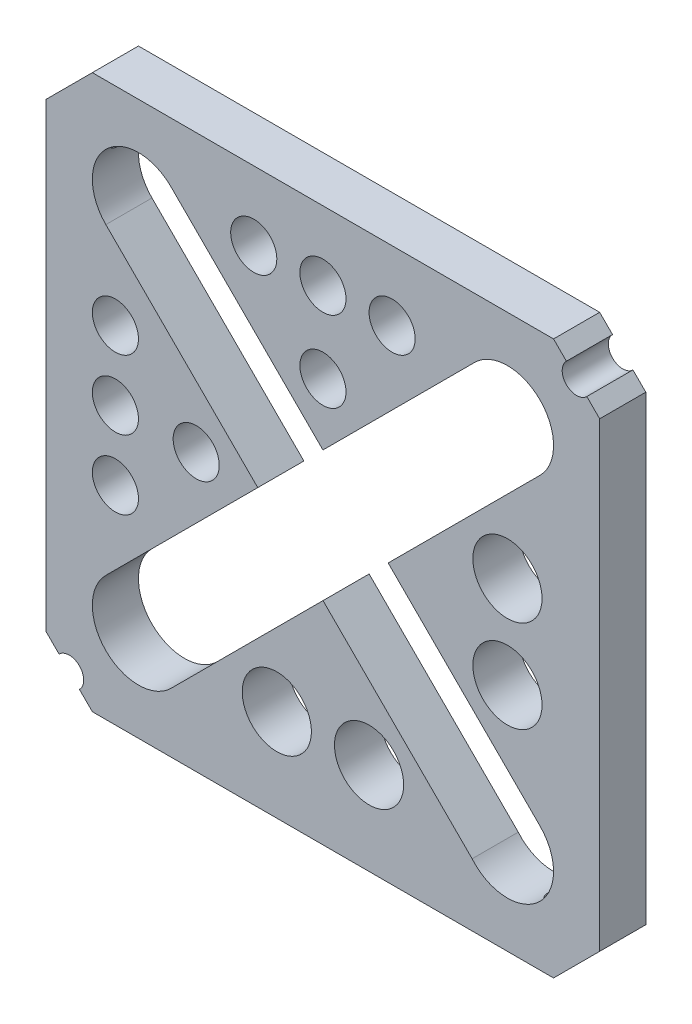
from build123d import *

# Parameters (mm, degrees)
BOSS_EXTRUDE1_DEPTH     = 6.35
CUT_EXTRUDE1_DEPTH      = 17.272
CUT_EXTRUDE1_DEPTH_BACK = 9.144
SKETCH2_R               = 4.7625
SKETCH2_R_2             = 3.175
CUT_EXTRUDE2_DEPTH      = 104.467984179
CUT_EXTRUDE2_DEPTH_BACK = 104.467984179
SKETCH4_R               = 2.0828


with BuildPart() as part:
    # Sketch1 → Boss-Extrude1 (new body)
    with BuildSketch(Plane.XY):
        with BuildLine():
            Line((-38.1, 31.75), (-31.75, 38.1))
            Line((-31.75, 38.1), (31.75, 38.1))
            Line((31.75, 38.1), (33.521834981, 36.328165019))
            ThreePointArc((33.521834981, 36.328165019), (33.521834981, 33.521834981), (36.328165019, 33.521834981))
            Line((36.328165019, 33.521834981), (38.1, 31.75))
            Line((38.1, 31.75), (38.1, -31.75))
            Line((38.1, -31.75), (31.75, -38.1))
            Line((31.75, -38.1), (-31.75, -38.1))
            Line((-31.75, -38.1), (-33.521834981, -36.328165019))
            ThreePointArc((-33.521834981, -36.328165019), (-33.521834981, -33.521834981), (-36.328165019, -33.521834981))
            Line((-36.328165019, -33.521834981), (-38.1, -31.75))
            Line((-38.1, -31.75), (-38.1, 31.75))
        make_face()
    extrude(amount=BOSS_EXTRUDE1_DEPTH)

    # Sketch2 → Cut-Extrude1 (cut, two sides: drawn at the far end of the back side and taken through both)
    with BuildSketch(Plane.XY.offset(-CUT_EXTRUDE1_DEPTH_BACK)):
        with BuildLine():
            Line((-8.973321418, 0.006934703), (-29.890128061, -20.909871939))
            ThreePointArc((-29.890128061, -20.909871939), (-29.890128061, -29.890128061), (-20.909871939, -29.890128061))
            Line((-20.909871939, -29.890128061), (0.009912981, -8.97034314))
            Line((0.009912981, -8.97034314), (20.53946849, -29.486286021))
            ThreePointArc((20.53946849, -29.486286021), (29.69220448, -30.079688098), (29.890128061, -20.909871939))
            Line((29.890128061, -20.909871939), (8.980256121, 0))
            Line((8.980256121, 0), (29.890128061, 20.909871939))
            ThreePointArc((29.890128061, 20.909871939), (29.890128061, 29.890128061), (20.909871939, 29.890128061))
            Line((20.909871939, 29.890128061), (0, 8.980256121))
            Line((0, 8.980256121), (-20.909871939, 29.890128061))
            ThreePointArc((-20.909871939, 29.890128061), (-29.890128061, 29.890128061), (-29.890128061, 20.909871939))
            Line((-29.890128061, 20.909871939), (-29.887148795, 20.90689465))
            Line((-29.887148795, 20.90689465), (-8.973321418, 0.006934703))
        make_face()
        with Locations((25.4, 6.35)):
            Circle(SKETCH2_R)
        with Locations((25.4, -6.35)):
            Circle(SKETCH2_R)
        with Locations((6.35, -25.4)):
            Circle(SKETCH2_R)
        with Locations((-6.35, -25.4)):
            Circle(SKETCH2_R)
        with Locations((-28.575, -9.525)):
            Circle(SKETCH2_R_2)
        with Locations((-17.4498, 0)):
            Circle(SKETCH2_R_2)
        with Locations((-28.575, 9.525)):
            Circle(SKETCH2_R_2)
        with Locations((-28.575, 0)):
            Circle(SKETCH2_R_2)
        with Locations((0, 17.4752)):
            Circle(SKETCH2_R_2)
        with Locations((9.525, 28.575)):
            Circle(SKETCH2_R_2)
        with Locations((0, 28.575)):
            Circle(SKETCH2_R_2)
        with Locations((-9.525, 28.575)):
            Circle(SKETCH2_R_2)
    extrude(amount=CUT_EXTRUDE1_DEPTH + CUT_EXTRUDE1_DEPTH_BACK, mode=Mode.SUBTRACT)

    # Sketch4 → Cut-Extrude2 (cut, two sides: drawn at the far end of the back side and taken through both)
    with BuildSketch(Plane(origin=(34.925, -34.925, 0), x_dir=(0, 0, -1), z_dir=(0.7071067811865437, -0.7071067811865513, 0)).offset(-CUT_EXTRUDE2_DEPTH_BACK)):
        with Locations(Location((-3.175, 0, 0), (0, 0, 90))):
            Circle(SKETCH4_R)
    extrude(amount=CUT_EXTRUDE2_DEPTH + CUT_EXTRUDE2_DEPTH_BACK, mode=Mode.SUBTRACT)


solid = part.part
